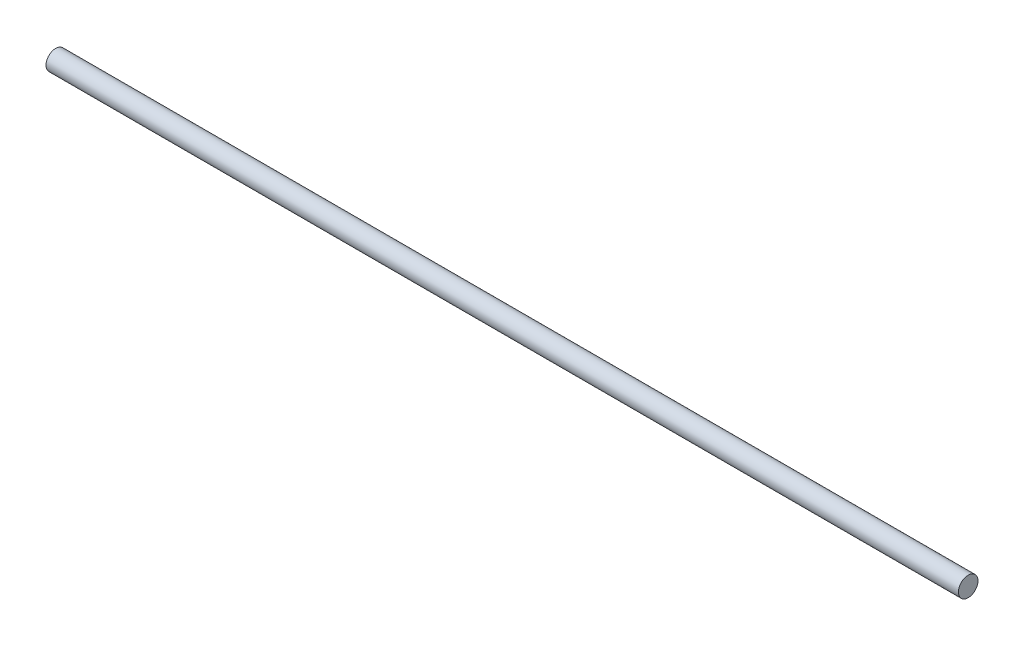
from build123d import *

# Parameters (mm, degrees)
SKETCH1_R           = 3
BOSS_EXTRUDE1_DEPTH = 280


with BuildPart() as part:
    # Sketch1 → Boss-Extrude1 (new body)
    with BuildSketch(Plane(origin=(0, 0, 0), x_dir=(0, 0, -1), z_dir=(1, 0, 0))):
        Circle(SKETCH1_R)
    extrude(amount=BOSS_EXTRUDE1_DEPTH)


solid = part.part
